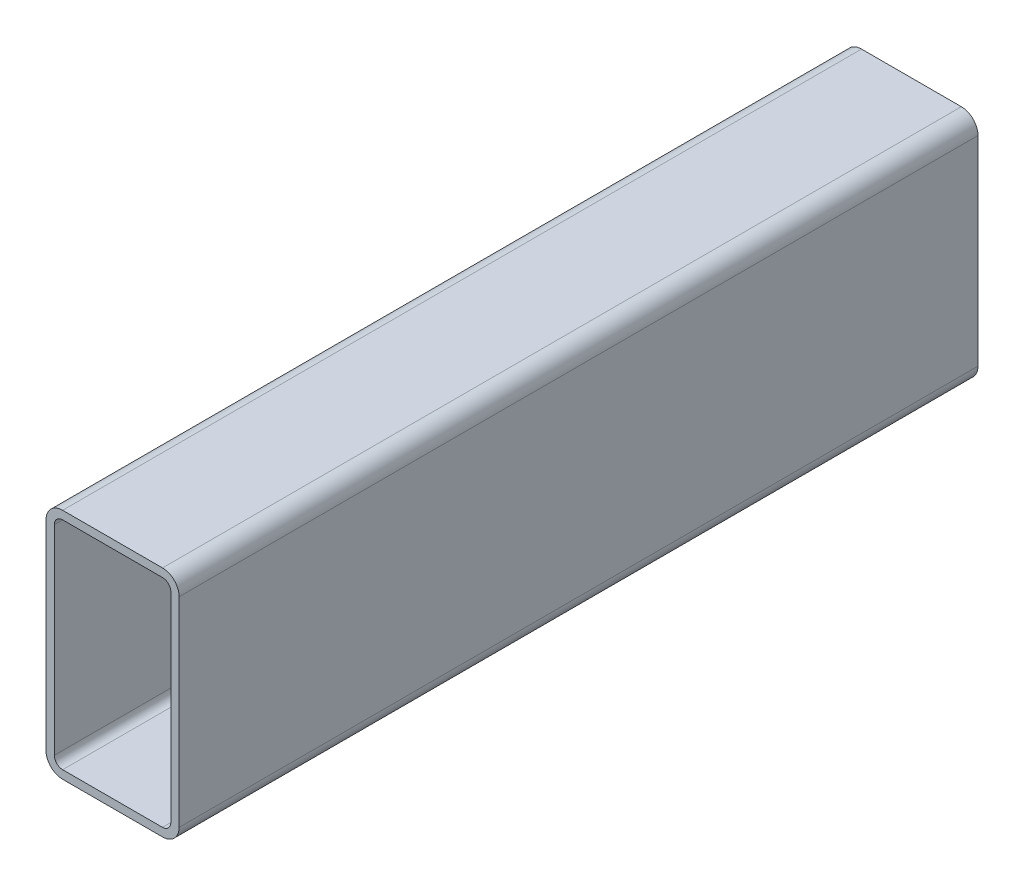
from build123d import *

# Parameters (mm, degrees)
BOSS_EXTRUDE1_DEPTH = 304.8


with BuildPart() as part:
    # Sketch1 → Boss-Extrude1 (new body)
    with BuildSketch(Plane.XY):
        with BuildLine():
            Line((6.35, 88.9), (44.45, 88.9))
            ThreePointArc((44.45, 88.9), (48.940128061, 87.040128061), (50.8, 82.55))
            Line((50.8, 82.55), (50.8, 6.35))
            ThreePointArc((50.8, 6.35), (48.940128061, 1.859871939), (44.45, 0))
            Line((44.45, 0), (6.35, 0))
            ThreePointArc((6.35, 0), (1.859871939, 1.859871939), (0, 6.35))
            Line((0, 6.35), (0, 82.55))
            ThreePointArc((0, 82.55), (1.859871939, 87.040128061), (6.35, 88.9))
        make_face()
        with BuildLine():
            Line((6.35, 85.725), (44.45, 85.725))
            ThreePointArc((44.45, 85.725), (46.69506403, 84.79506403), (47.625, 82.55))
            Line((47.625, 82.55), (47.625, 6.35))
            ThreePointArc((47.625, 6.35), (46.69506403, 4.10493597), (44.45, 3.175))
            Line((44.45, 3.175), (6.35, 3.175))
            ThreePointArc((6.35, 3.175), (4.10493597, 4.10493597), (3.175, 6.35))
            Line((3.175, 6.35), (3.175, 82.55))
            ThreePointArc((3.175, 82.55), (4.10493597, 84.79506403), (6.35, 85.725))
        make_face(mode=Mode.SUBTRACT)
    extrude(amount=BOSS_EXTRUDE1_DEPTH)


solid = part.part
